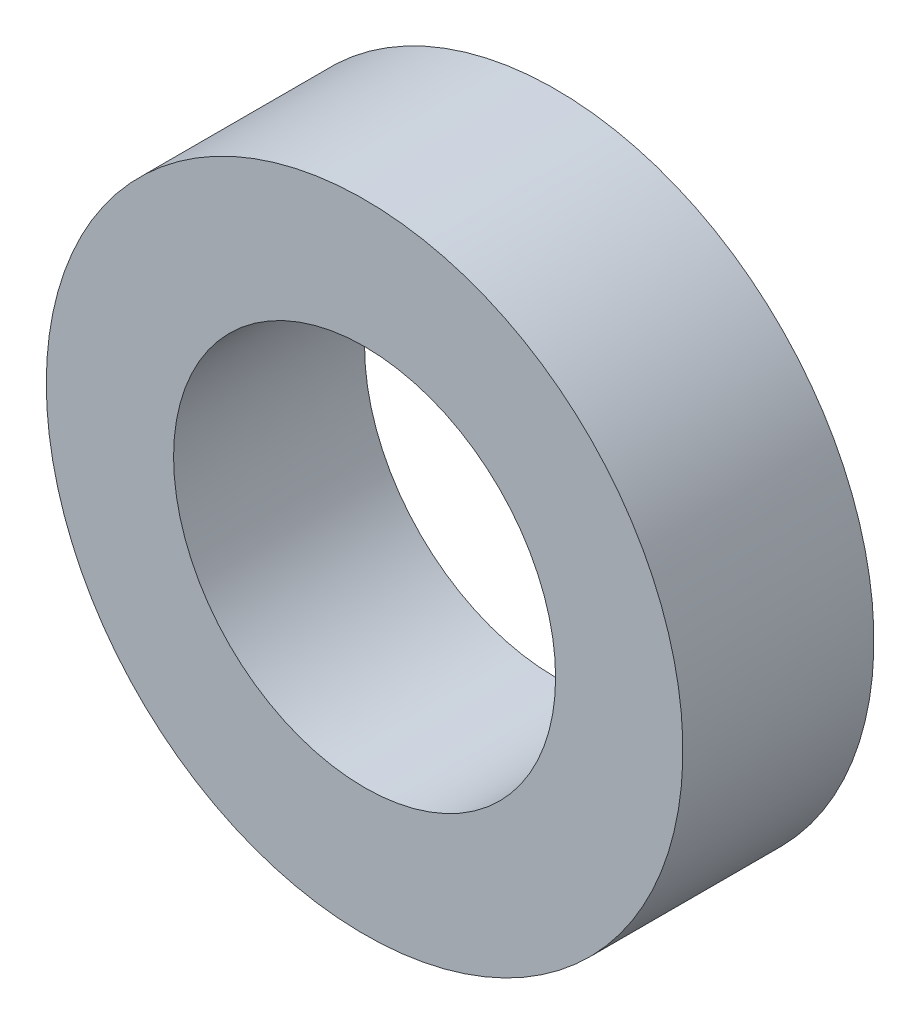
from build123d import *

# Parameters (mm, degrees)
SKETCH1_R      = 4.99872
SKETCH1_R_2    = 2.99974
EXTRUDE1_DEPTH = 2.99974


with BuildPart() as part:
    # Sketch1 → Extrude1 (new body)
    with BuildSketch(Plane.XY):
        with Locations(Location((0, 0, 0), (0, 0, 180))):
            Circle(SKETCH1_R)
        with Locations(Location((0, 0, 0), (0, 0, 180))):
            Circle(SKETCH1_R_2, mode=Mode.SUBTRACT)
    extrude(amount=EXTRUDE1_DEPTH)


solid = part.part
